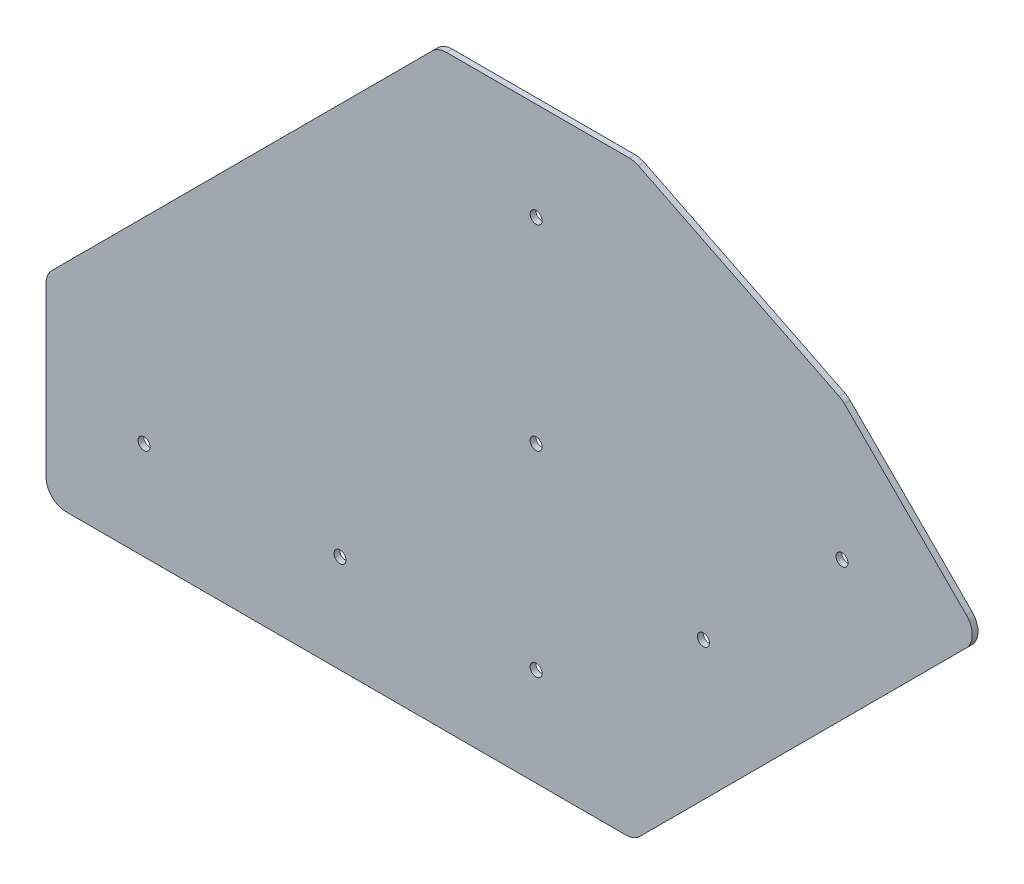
ISO-10303-21;
HEADER;
FILE_DESCRIPTION(('STEP AP214'),'2;1');
FILE_NAME('part.step','',(''),(''),'','','');
FILE_SCHEMA(('AUTOMOTIVE_DESIGN { 1 0 10303 214 1 1 1 1 }'));
ENDSEC;
DATA;
#1=APPLICATION_CONTEXT('core data for automotive mechanical design processes');
#2=APPLICATION_PROTOCOL_DEFINITION('international standard','automotive_design',2000,#1);
#3=PRODUCT_CONTEXT('',#1,'mechanical');
#4=PRODUCT('Part','Part','',(#3));
#5=PRODUCT_RELATED_PRODUCT_CATEGORY('part','',(#4));
#6=PRODUCT_DEFINITION_FORMATION('','',#4);
#7=PRODUCT_DEFINITION_CONTEXT('part definition',#1,'design');
#8=PRODUCT_DEFINITION('design','',#6,#7);
#9=PRODUCT_DEFINITION_SHAPE('','',#8);
#10=(LENGTH_UNIT() NAMED_UNIT(*) SI_UNIT(.MILLI.,.METRE.));
#11=(NAMED_UNIT(*) PLANE_ANGLE_UNIT() SI_UNIT($,.RADIAN.));
#12=(NAMED_UNIT(*) SI_UNIT($,.STERADIAN.) SOLID_ANGLE_UNIT());
#13=UNCERTAINTY_MEASURE_WITH_UNIT(LENGTH_MEASURE(1.E-05),#10,'distance_accuracy_value','');
#14=(GEOMETRIC_REPRESENTATION_CONTEXT(3) GLOBAL_UNCERTAINTY_ASSIGNED_CONTEXT((#13)) GLOBAL_UNIT_ASSIGNED_CONTEXT((#10,
#11,#12)) REPRESENTATION_CONTEXT('',''));
#15=CARTESIAN_POINT('',(0.,0.,0.));
#16=DIRECTION('',(0.,0.,1.));
#17=DIRECTION('',(1.,0.,0.));
#18=AXIS2_PLACEMENT_3D('',#15,#16,#17);
#19=CARTESIAN_POINT('',(5.55625,0.,0.));
#20=DIRECTION('',(0.,1.,0.));
#21=DIRECTION('',(0.,0.,1.));
#22=AXIS2_PLACEMENT_3D('',#19,#20,#21);
#23=PLANE('',#22);
#24=DIRECTION('',(0.,0.,-1.));
#25=VECTOR('',#24,1.);
#26=CARTESIAN_POINT('',(159.623525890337,0.,0.79375));
#27=LINE('',#26,#25);
#28=CARTESIAN_POINT('',(159.623525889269,0.,0.));
#29=VERTEX_POINT('',#28);
#30=CARTESIAN_POINT('',(159.623525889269,0.,1.5875));
#31=VERTEX_POINT('',#30);
#32=EDGE_CURVE('E177',#29,#31,#27,.F.);
#33=ORIENTED_EDGE('',*,*,#32,.T.);
#34=DIRECTION('',(1.,0.,0.));
#35=VECTOR('',#34,1.);
#36=CARTESIAN_POINT('',(128.2844898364,0.,1.5875));
#37=LINE('',#36,#35);
#38=CARTESIAN_POINT('',(5.55625000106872,0.,1.5875));
#39=VERTEX_POINT('',#38);
#40=EDGE_CURVE('E222',#39,#31,#37,.T.);
#41=ORIENTED_EDGE('',*,*,#40,.F.);
#42=DIRECTION('',(0.,0.,1.));
#43=VECTOR('',#42,1.);
#44=CARTESIAN_POINT('',(5.55625000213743,0.,0.79375));
#45=LINE('',#44,#43);
#46=CARTESIAN_POINT('',(5.55625000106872,0.,0.));
#47=VERTEX_POINT('',#46);
#48=EDGE_CURVE('E141',#39,#47,#45,.F.);
#49=ORIENTED_EDGE('',*,*,#48,.T.);
#50=DIRECTION('',(1.,0.,0.));
#51=VECTOR('',#50,1.);
#52=CARTESIAN_POINT('',(128.2844898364,0.,0.));
#53=LINE('',#52,#51);
#54=EDGE_CURVE('E246',#47,#29,#53,.T.);
#55=ORIENTED_EDGE('',*,*,#54,.T.);
#56=EDGE_LOOP('',(#33,#41,#49,#55));
#57=FACE_BOUND('',#56,.T.);
#58=ADVANCED_FACE('F15',(#57),#23,.F.);
#59=CARTESIAN_POINT('',(159.6235258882,5.55625,1.5875));
#60=DIRECTION('',(0.,0.,-1.));
#61=DIRECTION('',(0.,1.,0.));
#62=AXIS2_PLACEMENT_3D('',#59,#60,#61);
#63=CYLINDRICAL_SURFACE('',#62,5.55624999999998);
#64=ORIENTED_EDGE('',*,*,#32,.F.);
#65=CARTESIAN_POINT('',(159.6235258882,5.55625,0.));
#66=DIRECTION('',(0.,0.,-1.));
#67=DIRECTION('',(0.,1.,0.));
#68=AXIS2_PLACEMENT_3D('',#65,#66,#67);
#69=CIRCLE('',#68,5.55624999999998);
#70=CARTESIAN_POINT('',(163.55238795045,1.62738795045,0.));
#71=VERTEX_POINT('',#70);
#72=EDGE_CURVE('E243',#29,#71,#69,.F.);
#73=ORIENTED_EDGE('',*,*,#72,.T.);
#74=DIRECTION('',(0.,0.,1.));
#75=VECTOR('',#74,1.);
#76=CARTESIAN_POINT('',(163.5523879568,1.6273879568,0.79375));
#77=LINE('',#76,#75);
#78=CARTESIAN_POINT('',(163.552387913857,1.62738798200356,1.5875));
#79=VERTEX_POINT('',#78);
#80=EDGE_CURVE('E174',#71,#79,#77,.T.);
#81=ORIENTED_EDGE('',*,*,#80,.T.);
#82=CARTESIAN_POINT('',(159.6235258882,5.55625,1.5875));
#83=DIRECTION('',(0.,0.,-1.));
#84=DIRECTION('',(0.,1.,0.));
#85=AXIS2_PLACEMENT_3D('',#82,#83,#84);
#86=CIRCLE('',#85,5.55624999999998);
#87=EDGE_CURVE('E220',#31,#79,#86,.F.);
#88=ORIENTED_EDGE('',*,*,#87,.F.);
#89=EDGE_LOOP('',(#64,#73,#81,#88));
#90=FACE_BOUND('',#89,.T.);
#91=ADVANCED_FACE('F277',(#90),#63,.T.);
#92=CARTESIAN_POINT('',(253.4113592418,91.4863592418,0.));
#93=DIRECTION('',(-0.707106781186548,0.707106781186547,0.));
#94=DIRECTION('',(-0.707106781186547,-0.707106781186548,0.));
#95=AXIS2_PLACEMENT_3D('',#92,#93,#94);
#96=PLANE('',#95);
#97=ORIENTED_EDGE('',*,*,#80,.F.);
#98=DIRECTION('',(-0.707106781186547,-0.707106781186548,0.));
#99=VECTOR('',#98,1.);
#100=CARTESIAN_POINT('',(253.4113592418,91.4863592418,0.));
#101=LINE('',#100,#99);
#102=CARTESIAN_POINT('',(253.411359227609,91.486359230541,0.));
#103=VERTEX_POINT('',#102);
#104=EDGE_CURVE('E241',#71,#103,#101,.F.);
#105=ORIENTED_EDGE('',*,*,#104,.T.);
#106=DIRECTION('',(0.,0.,-1.));
#107=VECTOR('',#106,1.);
#108=CARTESIAN_POINT('',(253.411359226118,91.4863592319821,0.79375));
#109=LINE('',#108,#107);
#110=CARTESIAN_POINT('',(253.411359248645,91.4863592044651,1.5875));
#111=VERTEX_POINT('',#110);
#112=EDGE_CURVE('E115',#103,#111,#109,.F.);
#113=ORIENTED_EDGE('',*,*,#112,.T.);
#114=DIRECTION('',(0.707106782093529,0.707106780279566,0.));
#115=VECTOR('',#114,1.);
#116=CARTESIAN_POINT('',(163.552387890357,1.62738802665,1.5875));
#117=LINE('',#116,#115);
#118=EDGE_CURVE('E218',#79,#111,#117,.T.);
#119=ORIENTED_EDGE('',*,*,#118,.F.);
#120=EDGE_LOOP('',(#97,#105,#113,#119));
#121=FACE_BOUND('',#120,.T.);
#122=ADVANCED_FACE('F273',(#121),#96,.F.);
#123=CARTESIAN_POINT('',(249.4824971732,95.415221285,1.5875));
#124=DIRECTION('',(0.,0.,-1.));
#125=DIRECTION('',(0.,1.,0.));
#126=AXIS2_PLACEMENT_3D('',#123,#124,#125);
#127=CYLINDRICAL_SURFACE('',#126,5.55625000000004);
#128=ORIENTED_EDGE('',*,*,#112,.F.);
#129=CARTESIAN_POINT('',(249.4824971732,95.415221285,0.));
#130=DIRECTION('',(0.,0.,-1.));
#131=DIRECTION('',(0.,1.,0.));
#132=AXIS2_PLACEMENT_3D('',#129,#130,#131);
#133=CIRCLE('',#132,5.55625000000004);
#134=CARTESIAN_POINT('',(253.41135923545,99.34408333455,0.));
#135=VERTEX_POINT('',#134);
#136=EDGE_CURVE('E19',#103,#135,#133,.F.);
#137=ORIENTED_EDGE('',*,*,#136,.T.);
#138=DIRECTION('',(0.,0.,1.));
#139=VECTOR('',#138,1.);
#140=CARTESIAN_POINT('',(253.4113592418,99.3440833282,0.79375));
#141=LINE('',#140,#139);
#142=CARTESIAN_POINT('',(253.411359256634,99.344083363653,1.5875));
#143=VERTEX_POINT('',#142);
#144=EDGE_CURVE('E122',#135,#143,#141,.T.);
#145=ORIENTED_EDGE('',*,*,#144,.T.);
#146=CARTESIAN_POINT('',(249.4824971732,95.415221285,1.5875));
#147=DIRECTION('',(0.,0.,-1.));
#148=DIRECTION('',(0.,1.,0.));
#149=AXIS2_PLACEMENT_3D('',#146,#147,#148);
#150=CIRCLE('',#149,5.55625000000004);
#151=EDGE_CURVE('E216',#111,#143,#150,.F.);
#152=ORIENTED_EDGE('',*,*,#151,.F.);
#153=EDGE_LOOP('',(#128,#137,#145,#152));
#154=FACE_BOUND('',#153,.T.);
#155=ADVANCED_FACE('F139',(#154),#127,.T.);
#156=CARTESIAN_POINT('',(219.8196307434,132.9358118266,0.));
#157=DIRECTION('',(-0.707106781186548,-0.707106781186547,0.));
#158=DIRECTION('',(0.707106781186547,-0.707106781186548,0.));
#159=AXIS2_PLACEMENT_3D('',#156,#157,#158);
#160=PLANE('',#159);
#161=ORIENTED_EDGE('',*,*,#144,.F.);
#162=DIRECTION('',(0.707106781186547,-0.707106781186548,0.));
#163=VECTOR('',#162,1.);
#164=CARTESIAN_POINT('',(219.8196307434,132.9358118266,0.));
#165=LINE('',#164,#163);
#166=CARTESIAN_POINT('',(219.819630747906,132.935811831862,0.));
#167=VERTEX_POINT('',#166);
#168=EDGE_CURVE('E126',#135,#167,#165,.F.);
#169=ORIENTED_EDGE('',*,*,#168,.T.);
#170=DIRECTION('',(0.,0.,-1.));
#171=VECTOR('',#170,1.);
#172=CARTESIAN_POINT('',(219.819630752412,132.935811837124,0.79375));
#173=LINE('',#172,#171);
#174=CARTESIAN_POINT('',(219.819630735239,132.935811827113,1.5875));
#175=VERTEX_POINT('',#174);
#176=EDGE_CURVE('E128',#167,#175,#173,.F.);
#177=ORIENTED_EDGE('',*,*,#176,.T.);
#178=DIRECTION('',(-0.707106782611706,0.707106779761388,0.));
#179=VECTOR('',#178,1.);
#180=CARTESIAN_POINT('',(253.4113593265,99.344083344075,1.5875));
#181=LINE('',#180,#179);
#182=EDGE_CURVE('E127',#143,#175,#181,.T.);
#183=ORIENTED_EDGE('',*,*,#182,.F.);
#184=EDGE_LOOP('',(#161,#169,#177,#183));
#185=FACE_BOUND('',#184,.T.);
#186=ADVANCED_FACE('F124',(#185),#160,.F.);
#187=CARTESIAN_POINT('',(215.8907687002,129.0069497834,1.5875));
#188=DIRECTION('',(0.,0.,-1.));
#189=DIRECTION('',(0.,1.,0.));
#190=AXIS2_PLACEMENT_3D('',#187,#188,#189);
#191=CYLINDRICAL_SURFACE('',#190,5.55625000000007);
#192=ORIENTED_EDGE('',*,*,#176,.F.);
#193=CARTESIAN_POINT('',(215.8907687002,129.0069497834,0.));
#194=DIRECTION('',(0.,0.,-1.));
#195=DIRECTION('',(0.,1.,0.));
#196=AXIS2_PLACEMENT_3D('',#193,#194,#195);
#197=CIRCLE('',#196,5.55625000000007);
#198=CARTESIAN_POINT('',(218.356036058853,133.986344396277,0.));
#199=VERTEX_POINT('',#198);
#200=EDGE_CURVE('E138',#167,#199,#197,.F.);
#201=ORIENTED_EDGE('',*,*,#200,.T.);
#202=DIRECTION('',(0.,0.,1.));
#203=VECTOR('',#202,1.);
#204=CARTESIAN_POINT('',(218.3560360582,133.9863443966,0.79375));
#205=LINE('',#204,#203);
#206=CARTESIAN_POINT('',(218.356036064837,133.986344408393,1.5875));
#207=VERTEX_POINT('',#206);
#208=EDGE_CURVE('E169',#199,#207,#205,.T.);
#209=ORIENTED_EDGE('',*,*,#208,.T.);
#210=CARTESIAN_POINT('',(215.8907687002,129.0069497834,1.5875));
#211=DIRECTION('',(0.,0.,-1.));
#212=DIRECTION('',(0.,1.,0.));
#213=AXIS2_PLACEMENT_3D('',#210,#211,#212);
#214=CIRCLE('',#213,5.55625000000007);
#215=EDGE_CURVE('E213',#175,#207,#214,.F.);
#216=ORIENTED_EDGE('',*,*,#215,.F.);
#217=EDGE_LOOP('',(#192,#201,#209,#216));
#218=FACE_BOUND('',#217,.T.);
#219=ADVANCED_FACE('F267',(#218),#191,.T.);
#220=CARTESIAN_POINT('',(163.0901436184,161.3481446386,0.));
#221=DIRECTION('',(-0.443692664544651,-0.896179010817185,0.));
#222=DIRECTION('',(0.896179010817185,-0.443692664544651,0.));
#223=AXIS2_PLACEMENT_3D('',#220,#221,#222);
#224=PLANE('',#223);
#225=ORIENTED_EDGE('',*,*,#208,.F.);
#226=DIRECTION('',(0.896179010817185,-0.443692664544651,0.));
#227=VECTOR('',#226,1.);
#228=CARTESIAN_POINT('',(163.0901436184,161.3481446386,0.));
#229=LINE('',#228,#227);
#230=CARTESIAN_POINT('',(163.090143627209,161.348144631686,0.));
#231=VERTEX_POINT('',#230);
#232=EDGE_CURVE('E263',#199,#231,#229,.F.);
#233=ORIENTED_EDGE('',*,*,#232,.T.);
#234=DIRECTION('',(0.,0.,-1.));
#235=VECTOR('',#234,1.);
#236=CARTESIAN_POINT('',(163.090143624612,161.34814463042,0.79375));
#237=LINE('',#236,#235);
#238=CARTESIAN_POINT('',(163.090143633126,161.348144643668,1.5875));
#239=VERTEX_POINT('',#238);
#240=EDGE_CURVE('E166',#231,#239,#237,.F.);
#241=ORIENTED_EDGE('',*,*,#240,.T.);
#242=DIRECTION('',(-0.896179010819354,0.44369266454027,0.));
#243=VECTOR('',#242,1.);
#244=CARTESIAN_POINT('',(218.356036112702,133.986344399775,1.5875));
#245=LINE('',#244,#243);
#246=EDGE_CURVE('E211',#207,#239,#245,.T.);
#247=ORIENTED_EDGE('',*,*,#246,.F.);
#248=EDGE_LOOP('',(#225,#233,#241,#247));
#249=FACE_BOUND('',#248,.T.);
#250=ADVANCED_FACE('F308',(#249),#224,.F.);
#251=CARTESIAN_POINT('',(160.6248762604,156.36875,1.5875));
#252=DIRECTION('',(0.,0.,-1.));
#253=DIRECTION('',(0.,1.,0.));
#254=AXIS2_PLACEMENT_3D('',#251,#252,#253);
#255=CYLINDRICAL_SURFACE('',#254,5.55624999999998);
#256=ORIENTED_EDGE('',*,*,#240,.F.);
#257=CARTESIAN_POINT('',(160.6248762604,156.36875,0.));
#258=DIRECTION('',(0.,0.,-1.));
#259=DIRECTION('',(0.,1.,0.));
#260=AXIS2_PLACEMENT_3D('',#257,#258,#259);
#261=CIRCLE('',#260,5.55624999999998);
#262=CARTESIAN_POINT('',(160.6248762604,161.925,0.));
#263=VERTEX_POINT('',#262);
#264=EDGE_CURVE('E260',#231,#263,#261,.F.);
#265=ORIENTED_EDGE('',*,*,#264,.T.);
#266=DIRECTION('',(0.,0.,1.));
#267=VECTOR('',#266,1.);
#268=CARTESIAN_POINT('',(160.6248762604,161.925,0.79375));
#269=LINE('',#268,#267);
#270=CARTESIAN_POINT('',(160.6248762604,161.925,1.5875));
#271=VERTEX_POINT('',#270);
#272=EDGE_CURVE('E163',#263,#271,#269,.T.);
#273=ORIENTED_EDGE('',*,*,#272,.T.);
#274=CARTESIAN_POINT('',(160.6248762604,156.36875,1.5875));
#275=DIRECTION('',(0.,0.,-1.));
#276=DIRECTION('',(0.,1.,0.));
#277=AXIS2_PLACEMENT_3D('',#274,#275,#276);
#278=CIRCLE('',#277,5.55624999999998);
#279=EDGE_CURVE('E209',#239,#271,#278,.F.);
#280=ORIENTED_EDGE('',*,*,#279,.F.);
#281=EDGE_LOOP('',(#256,#265,#273,#280));
#282=FACE_BOUND('',#281,.T.);
#283=ADVANCED_FACE('F305',(#282),#255,.T.);
#284=CARTESIAN_POINT('',(110.2514741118,161.925,1.5875));
#285=DIRECTION('',(0.,-1.,0.));
#286=DIRECTION('',(0.,0.,-1.));
#287=AXIS2_PLACEMENT_3D('',#284,#285,#286);
#288=PLANE('',#287);
#289=ORIENTED_EDGE('',*,*,#272,.F.);
#290=DIRECTION('',(-1.,0.,0.));
#291=VECTOR('',#290,1.);
#292=CARTESIAN_POINT('',(128.2844898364,161.925,0.));
#293=LINE('',#292,#291);
#294=CARTESIAN_POINT('',(110.25147411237,161.925,0.));
#295=VERTEX_POINT('',#294);
#296=EDGE_CURVE('E149',#263,#295,#293,.T.);
#297=ORIENTED_EDGE('',*,*,#296,.T.);
#298=DIRECTION('',(0.,0.,-1.));
#299=VECTOR('',#298,1.);
#300=CARTESIAN_POINT('',(110.25147411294,161.925,0.79375));
#301=LINE('',#300,#299);
#302=CARTESIAN_POINT('',(110.25147411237,161.925,1.5875));
#303=VERTEX_POINT('',#302);
#304=EDGE_CURVE('E160',#295,#303,#301,.F.);
#305=ORIENTED_EDGE('',*,*,#304,.T.);
#306=DIRECTION('',(-1.,0.,0.));
#307=VECTOR('',#306,1.);
#308=CARTESIAN_POINT('',(128.2844898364,161.925,1.5875));
#309=LINE('',#308,#307);
#310=EDGE_CURVE('E208',#271,#303,#309,.T.);
#311=ORIENTED_EDGE('',*,*,#310,.F.);
#312=EDGE_LOOP('',(#289,#297,#305,#311));
#313=FACE_BOUND('',#312,.T.);
#314=ADVANCED_FACE('F302',(#313),#288,.F.);
#315=CARTESIAN_POINT('',(110.2514741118,156.36875,1.5875));
#316=DIRECTION('',(0.,0.,-1.));
#317=DIRECTION('',(0.,1.,0.));
#318=AXIS2_PLACEMENT_3D('',#315,#316,#317);
#319=CYLINDRICAL_SURFACE('',#318,5.55625000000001);
#320=ORIENTED_EDGE('',*,*,#304,.F.);
#321=CARTESIAN_POINT('',(110.2514741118,156.36875,0.));
#322=DIRECTION('',(0.,0.,-1.));
#323=DIRECTION('',(0.,1.,0.));
#324=AXIS2_PLACEMENT_3D('',#321,#322,#323);
#325=CIRCLE('',#324,5.55625000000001);
#326=CARTESIAN_POINT('',(106.32261204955,160.29761204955,0.));
#327=VERTEX_POINT('',#326);
#328=EDGE_CURVE('E257',#295,#327,#325,.F.);
#329=ORIENTED_EDGE('',*,*,#328,.T.);
#330=DIRECTION('',(0.,0.,1.));
#331=VECTOR('',#330,1.);
#332=CARTESIAN_POINT('',(106.3226120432,160.2976120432,0.79375));
#333=LINE('',#332,#331);
#334=CARTESIAN_POINT('',(106.32261208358,160.29761201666,1.5875));
#335=VERTEX_POINT('',#334);
#336=EDGE_CURVE('E157',#327,#335,#333,.T.);
#337=ORIENTED_EDGE('',*,*,#336,.T.);
#338=CARTESIAN_POINT('',(110.2514741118,156.36875,1.5875));
#339=DIRECTION('',(0.,0.,-1.));
#340=DIRECTION('',(0.,1.,0.));
#341=AXIS2_PLACEMENT_3D('',#338,#339,#340);
#342=CIRCLE('',#341,5.55625000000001);
#343=EDGE_CURVE('E206',#303,#335,#342,.F.);
#344=ORIENTED_EDGE('',*,*,#343,.F.);
#345=EDGE_LOOP('',(#320,#329,#337,#344));
#346=FACE_BOUND('',#345,.T.);
#347=ADVANCED_FACE('F298',(#346),#319,.T.);
#348=CARTESIAN_POINT('',(1.6273879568,55.6023879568,0.));
#349=DIRECTION('',(0.707106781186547,-0.707106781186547,0.));
#350=DIRECTION('',(0.707106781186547,0.707106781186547,0.));
#351=AXIS2_PLACEMENT_3D('',#348,#349,#350);
#352=PLANE('',#351);
#353=ORIENTED_EDGE('',*,*,#336,.F.);
#354=DIRECTION('',(0.707106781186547,0.707106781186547,0.));
#355=VECTOR('',#354,1.);
#356=CARTESIAN_POINT('',(1.6273879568,55.6023879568,0.));
#357=LINE('',#356,#355);
#358=CARTESIAN_POINT('',(1.62738794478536,55.6023879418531,0.));
#359=VERTEX_POINT('',#358);
#360=EDGE_CURVE('E254',#327,#359,#357,.F.);
#361=ORIENTED_EDGE('',*,*,#360,.T.);
#362=DIRECTION('',(0.,0.,-1.));
#363=VECTOR('',#362,1.);
#364=CARTESIAN_POINT('',(1.62738794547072,55.6023879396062,0.79375));
#365=LINE('',#364,#363);
#366=CARTESIAN_POINT('',(1.62738796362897,55.6023879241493,1.5875));
#367=VERTEX_POINT('',#366);
#368=EDGE_CURVE('E154',#359,#367,#365,.F.);
#369=ORIENTED_EDGE('',*,*,#368,.T.);
#370=DIRECTION('',(-0.707106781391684,-0.707106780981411,0.));
#371=VECTOR('',#370,1.);
#372=CARTESIAN_POINT('',(106.322612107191,160.29761197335,1.5875));
#373=LINE('',#372,#371);
#374=EDGE_CURVE('E204',#335,#367,#373,.T.);
#375=ORIENTED_EDGE('',*,*,#374,.F.);
#376=EDGE_LOOP('',(#353,#361,#369,#375));
#377=FACE_BOUND('',#376,.T.);
#378=ADVANCED_FACE('F293',(#377),#352,.F.);
#379=CARTESIAN_POINT('',(5.55625,51.6735258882,1.5875));
#380=DIRECTION('',(0.,0.,-1.));
#381=DIRECTION('',(0.,1.,0.));
#382=AXIS2_PLACEMENT_3D('',#379,#380,#381);
#383=CYLINDRICAL_SURFACE('',#382,5.55625);
#384=ORIENTED_EDGE('',*,*,#368,.F.);
#385=CARTESIAN_POINT('',(5.55625,51.6735258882,0.));
#386=DIRECTION('',(0.,0.,-1.));
#387=DIRECTION('',(0.,1.,0.));
#388=AXIS2_PLACEMENT_3D('',#385,#386,#387);
#389=CIRCLE('',#388,5.55625);
#390=CARTESIAN_POINT('',(0.,51.6735258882,0.));
#391=VERTEX_POINT('',#390);
#392=EDGE_CURVE('E251',#359,#391,#389,.F.);
#393=ORIENTED_EDGE('',*,*,#392,.T.);
#394=DIRECTION('',(0.,0.,1.));
#395=VECTOR('',#394,1.);
#396=CARTESIAN_POINT('',(0.,51.6735258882,0.79375));
#397=LINE('',#396,#395);
#398=CARTESIAN_POINT('',(0.,51.6735258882,1.5875));
#399=VERTEX_POINT('',#398);
#400=EDGE_CURVE('E146',#391,#399,#397,.T.);
#401=ORIENTED_EDGE('',*,*,#400,.T.);
#402=CARTESIAN_POINT('',(5.55625,51.6735258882,1.5875));
#403=DIRECTION('',(0.,0.,-1.));
#404=DIRECTION('',(0.,1.,0.));
#405=AXIS2_PLACEMENT_3D('',#402,#403,#404);
#406=CIRCLE('',#405,5.55625);
#407=EDGE_CURVE('E202',#367,#399,#406,.F.);
#408=ORIENTED_EDGE('',*,*,#407,.F.);
#409=EDGE_LOOP('',(#384,#393,#401,#408));
#410=FACE_BOUND('',#409,.T.);
#411=ADVANCED_FACE('F289',(#410),#383,.T.);
#412=CARTESIAN_POINT('',(0.,5.55625,0.));
#413=DIRECTION('',(1.,0.,0.));
#414=DIRECTION('',(0.,1.,0.));
#415=AXIS2_PLACEMENT_3D('',#412,#413,#414);
#416=PLANE('',#415);
#417=DIRECTION('',(0.,0.,-1.));
#418=VECTOR('',#417,1.);
#419=CARTESIAN_POINT('',(0.,5.55624999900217,0.79375));
#420=LINE('',#419,#418);
#421=CARTESIAN_POINT('',(0.,5.55624999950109,0.));
#422=VERTEX_POINT('',#421);
#423=CARTESIAN_POINT('',(0.,5.55624999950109,1.5875));
#424=VERTEX_POINT('',#423);
#425=EDGE_CURVE('E140',#422,#424,#420,.F.);
#426=ORIENTED_EDGE('',*,*,#425,.T.);
#427=DIRECTION('',(0.,-1.,0.));
#428=VECTOR('',#427,1.);
#429=CARTESIAN_POINT('',(0.,80.9625,1.5875));
#430=LINE('',#429,#428);
#431=EDGE_CURVE('E34',#399,#424,#430,.T.);
#432=ORIENTED_EDGE('',*,*,#431,.F.);
#433=ORIENTED_EDGE('',*,*,#400,.F.);
#434=DIRECTION('',(0.,-1.,0.));
#435=VECTOR('',#434,1.);
#436=CARTESIAN_POINT('',(0.,80.9625,0.));
#437=LINE('',#436,#435);
#438=EDGE_CURVE('E250',#391,#422,#437,.T.);
#439=ORIENTED_EDGE('',*,*,#438,.T.);
#440=EDGE_LOOP('',(#426,#432,#433,#439));
#441=FACE_BOUND('',#440,.T.);
#442=ADVANCED_FACE('F285',(#441),#416,.F.);
#443=CARTESIAN_POINT('',(5.55625,5.55625,1.5875));
#444=DIRECTION('',(0.,0.,-1.));
#445=DIRECTION('',(0.,1.,0.));
#446=AXIS2_PLACEMENT_3D('',#443,#444,#445);
#447=CYLINDRICAL_SURFACE('',#446,5.55625);
#448=ORIENTED_EDGE('',*,*,#425,.F.);
#449=CARTESIAN_POINT('',(5.55625,5.55625,0.));
#450=DIRECTION('',(0.,0.,-1.));
#451=DIRECTION('',(0.,1.,0.));
#452=AXIS2_PLACEMENT_3D('',#449,#450,#451);
#453=CIRCLE('',#452,5.55625);
#454=EDGE_CURVE('E247',#422,#47,#453,.F.);
#455=ORIENTED_EDGE('',*,*,#454,.T.);
#456=ORIENTED_EDGE('',*,*,#48,.F.);
#457=CARTESIAN_POINT('',(5.55625,5.55625,1.5875));
#458=DIRECTION('',(0.,0.,-1.));
#459=DIRECTION('',(0.,1.,0.));
#460=AXIS2_PLACEMENT_3D('',#457,#458,#459);
#461=CIRCLE('',#460,5.55625);
#462=EDGE_CURVE('E200',#424,#39,#461,.F.);
#463=ORIENTED_EDGE('',*,*,#462,.F.);
#464=EDGE_LOOP('',(#448,#455,#456,#463));
#465=FACE_BOUND('',#464,.T.);
#466=ADVANCED_FACE('F353',(#465),#447,.T.);
#467=CARTESIAN_POINT('',(134.9375,80.9625,0.));
#468=DIRECTION('',(0.,0.,1.));
#469=DIRECTION('',(1.,0.,0.));
#470=AXIS2_PLACEMENT_3D('',#467,#468,#469);
#471=CYLINDRICAL_SURFACE('',#470,1.65100000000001);
#472=CARTESIAN_POINT('',(134.9375,80.9625,1.5875));
#473=DIRECTION('',(0.,0.,1.));
#474=DIRECTION('',(1.,0.,0.));
#475=AXIS2_PLACEMENT_3D('',#472,#473,#474);
#476=CIRCLE('',#475,1.65100000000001);
#477=CARTESIAN_POINT('',(136.5885,80.9625,1.5875));
#478=VERTEX_POINT('',#477);
#479=EDGE_CURVE('E197',#478,#478,#476,.F.);
#480=ORIENTED_EDGE('',*,*,#479,.F.);
#481=EDGE_LOOP('',(#480));
#482=FACE_BOUND('',#481,.T.);
#483=CARTESIAN_POINT('',(134.9375,80.9625,0.));
#484=DIRECTION('',(0.,0.,1.));
#485=DIRECTION('',(1.,0.,0.));
#486=AXIS2_PLACEMENT_3D('',#483,#484,#485);
#487=CIRCLE('',#486,1.65100000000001);
#488=CARTESIAN_POINT('',(136.5885,80.9625,0.));
#489=VERTEX_POINT('',#488);
#490=EDGE_CURVE('E238',#489,#489,#487,.F.);
#491=ORIENTED_EDGE('',*,*,#490,.T.);
#492=EDGE_LOOP('',(#491));
#493=FACE_BOUND('',#492,.T.);
#494=ADVANCED_FACE('F349',(#482,#493),#471,.F.);
#495=CARTESIAN_POINT('',(26.9875,26.9875,0.));
#496=DIRECTION('',(0.,0.,1.));
#497=DIRECTION('',(1.,0.,0.));
#498=AXIS2_PLACEMENT_3D('',#495,#496,#497);
#499=CYLINDRICAL_SURFACE('',#498,1.651);
#500=CARTESIAN_POINT('',(26.9875,26.9875,1.5875));
#501=DIRECTION('',(0.,0.,1.));
#502=DIRECTION('',(1.,0.,0.));
#503=AXIS2_PLACEMENT_3D('',#500,#501,#502);
#504=CIRCLE('',#503,1.651);
#505=CARTESIAN_POINT('',(28.6385,26.9875,1.5875));
#506=VERTEX_POINT('',#505);
#507=EDGE_CURVE('E194',#506,#506,#504,.F.);
#508=ORIENTED_EDGE('',*,*,#507,.F.);
#509=EDGE_LOOP('',(#508));
#510=FACE_BOUND('',#509,.T.);
#511=CARTESIAN_POINT('',(26.9875,26.9875,0.));
#512=DIRECTION('',(0.,0.,1.));
#513=DIRECTION('',(1.,0.,0.));
#514=AXIS2_PLACEMENT_3D('',#511,#512,#513);
#515=CIRCLE('',#514,1.651);
#516=CARTESIAN_POINT('',(28.6385,26.9875,0.));
#517=VERTEX_POINT('',#516);
#518=EDGE_CURVE('E235',#517,#517,#515,.F.);
#519=ORIENTED_EDGE('',*,*,#518,.T.);
#520=EDGE_LOOP('',(#519));
#521=FACE_BOUND('',#520,.T.);
#522=ADVANCED_FACE('F345',(#510,#521),#499,.F.);
#523=CARTESIAN_POINT('',(80.9625,26.9875,0.));
#524=DIRECTION('',(0.,0.,1.));
#525=DIRECTION('',(1.,0.,0.));
#526=AXIS2_PLACEMENT_3D('',#523,#524,#525);
#527=CYLINDRICAL_SURFACE('',#526,1.65099999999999);
#528=CARTESIAN_POINT('',(80.9625,26.9875,1.5875));
#529=DIRECTION('',(0.,0.,1.));
#530=DIRECTION('',(1.,0.,0.));
#531=AXIS2_PLACEMENT_3D('',#528,#529,#530);
#532=CIRCLE('',#531,1.65099999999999);
#533=CARTESIAN_POINT('',(82.6135,26.9875,1.5875));
#534=VERTEX_POINT('',#533);
#535=EDGE_CURVE('E191',#534,#534,#532,.F.);
#536=ORIENTED_EDGE('',*,*,#535,.F.);
#537=EDGE_LOOP('',(#536));
#538=FACE_BOUND('',#537,.T.);
#539=CARTESIAN_POINT('',(80.9625,26.9875,0.));
#540=DIRECTION('',(0.,0.,1.));
#541=DIRECTION('',(1.,0.,0.));
#542=AXIS2_PLACEMENT_3D('',#539,#540,#541);
#543=CIRCLE('',#542,1.65099999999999);
#544=CARTESIAN_POINT('',(82.6135,26.9875,0.));
#545=VERTEX_POINT('',#544);
#546=EDGE_CURVE('E232',#545,#545,#543,.F.);
#547=ORIENTED_EDGE('',*,*,#546,.T.);
#548=EDGE_LOOP('',(#547));
#549=FACE_BOUND('',#548,.T.);
#550=ADVANCED_FACE('F341',(#538,#549),#527,.F.);
#551=CARTESIAN_POINT('',(181.008044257,57.249132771,0.));
#552=DIRECTION('',(0.,0.,1.));
#553=DIRECTION('',(1.,0.,0.));
#554=AXIS2_PLACEMENT_3D('',#551,#552,#553);
#555=CYLINDRICAL_SURFACE('',#554,1.65100000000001);
#556=CARTESIAN_POINT('',(181.008044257,57.249132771,1.5875));
#557=DIRECTION('',(0.,0.,1.));
#558=DIRECTION('',(1.,0.,0.));
#559=AXIS2_PLACEMENT_3D('',#556,#557,#558);
#560=CIRCLE('',#559,1.65100000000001);
#561=CARTESIAN_POINT('',(182.659044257,57.249132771,1.5875));
#562=VERTEX_POINT('',#561);
#563=EDGE_CURVE('E188',#562,#562,#560,.F.);
#564=ORIENTED_EDGE('',*,*,#563,.F.);
#565=EDGE_LOOP('',(#564));
#566=FACE_BOUND('',#565,.T.);
#567=CARTESIAN_POINT('',(181.008044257,57.249132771,0.));
#568=DIRECTION('',(0.,0.,1.));
#569=DIRECTION('',(1.,0.,0.));
#570=AXIS2_PLACEMENT_3D('',#567,#568,#569);
#571=CIRCLE('',#570,1.65100000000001);
#572=CARTESIAN_POINT('',(182.659044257,57.249132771,0.));
#573=VERTEX_POINT('',#572);
#574=EDGE_CURVE('E229',#573,#573,#571,.F.);
#575=ORIENTED_EDGE('',*,*,#574,.T.);
#576=EDGE_LOOP('',(#575));
#577=FACE_BOUND('',#576,.T.);
#578=ADVANCED_FACE('F337',(#566,#577),#555,.F.);
#579=CARTESIAN_POINT('',(219.174132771,95.415221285,0.));
#580=DIRECTION('',(0.,0.,1.));
#581=DIRECTION('',(1.,0.,0.));
#582=AXIS2_PLACEMENT_3D('',#579,#580,#581);
#583=CYLINDRICAL_SURFACE('',#582,1.65100000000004);
#584=CARTESIAN_POINT('',(219.174132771,95.415221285,1.5875));
#585=DIRECTION('',(0.,0.,1.));
#586=DIRECTION('',(1.,0.,0.));
#587=AXIS2_PLACEMENT_3D('',#584,#585,#586);
#588=CIRCLE('',#587,1.65100000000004);
#589=CARTESIAN_POINT('',(220.825132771,95.415221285,1.5875));
#590=VERTEX_POINT('',#589);
#591=EDGE_CURVE('E185',#590,#590,#588,.F.);
#592=ORIENTED_EDGE('',*,*,#591,.F.);
#593=EDGE_LOOP('',(#592));
#594=FACE_BOUND('',#593,.T.);
#595=CARTESIAN_POINT('',(219.174132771,95.415221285,0.));
#596=DIRECTION('',(0.,0.,1.));
#597=DIRECTION('',(1.,0.,0.));
#598=AXIS2_PLACEMENT_3D('',#595,#596,#597);
#599=CIRCLE('',#598,1.65100000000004);
#600=CARTESIAN_POINT('',(220.825132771,95.415221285,0.));
#601=VERTEX_POINT('',#600);
#602=EDGE_CURVE('E226',#601,#601,#599,.F.);
#603=ORIENTED_EDGE('',*,*,#602,.T.);
#604=EDGE_LOOP('',(#603));
#605=FACE_BOUND('',#604,.T.);
#606=ADVANCED_FACE('F333',(#594,#605),#583,.F.);
#607=CARTESIAN_POINT('',(134.9375,26.9875,0.));
#608=DIRECTION('',(0.,0.,1.));
#609=DIRECTION('',(1.,0.,0.));
#610=AXIS2_PLACEMENT_3D('',#607,#608,#609);
#611=CYLINDRICAL_SURFACE('',#610,1.65100000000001);
#612=CARTESIAN_POINT('',(134.9375,26.9875,1.5875));
#613=DIRECTION('',(0.,0.,1.));
#614=DIRECTION('',(1.,0.,0.));
#615=AXIS2_PLACEMENT_3D('',#612,#613,#614);
#616=CIRCLE('',#615,1.65100000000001);
#617=CARTESIAN_POINT('',(136.5885,26.9875,1.5875));
#618=VERTEX_POINT('',#617);
#619=EDGE_CURVE('E182',#618,#618,#616,.F.);
#620=ORIENTED_EDGE('',*,*,#619,.F.);
#621=EDGE_LOOP('',(#620));
#622=FACE_BOUND('',#621,.T.);
#623=CARTESIAN_POINT('',(134.9375,26.9875,0.));
#624=DIRECTION('',(0.,0.,1.));
#625=DIRECTION('',(1.,0.,0.));
#626=AXIS2_PLACEMENT_3D('',#623,#624,#625);
#627=CIRCLE('',#626,1.65100000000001);
#628=CARTESIAN_POINT('',(136.5885,26.9875,0.));
#629=VERTEX_POINT('',#628);
#630=EDGE_CURVE('E223',#629,#629,#627,.F.);
#631=ORIENTED_EDGE('',*,*,#630,.T.);
#632=EDGE_LOOP('',(#631));
#633=FACE_BOUND('',#632,.T.);
#634=ADVANCED_FACE('F330',(#622,#633),#611,.F.);
#635=CARTESIAN_POINT('',(0.,0.,0.));
#636=DIRECTION('',(0.,0.,1.));
#637=DIRECTION('',(1.,0.,0.));
#638=AXIS2_PLACEMENT_3D('',#635,#636,#637);
#639=PLANE('',#638);
#640=ORIENTED_EDGE('',*,*,#630,.F.);
#641=EDGE_LOOP('',(#640));
#642=FACE_BOUND('',#641,.T.);
#643=ORIENTED_EDGE('',*,*,#602,.F.);
#644=EDGE_LOOP('',(#643));
#645=FACE_BOUND('',#644,.T.);
#646=ORIENTED_EDGE('',*,*,#574,.F.);
#647=EDGE_LOOP('',(#646));
#648=FACE_BOUND('',#647,.T.);
#649=ORIENTED_EDGE('',*,*,#546,.F.);
#650=EDGE_LOOP('',(#649));
#651=FACE_BOUND('',#650,.T.);
#652=ORIENTED_EDGE('',*,*,#518,.F.);
#653=EDGE_LOOP('',(#652));
#654=FACE_BOUND('',#653,.T.);
#655=ORIENTED_EDGE('',*,*,#490,.F.);
#656=EDGE_LOOP('',(#655));
#657=FACE_BOUND('',#656,.T.);
#658=CARTESIAN_POINT('',(134.9375,134.9375,0.));
#659=DIRECTION('',(0.,0.,1.));
#660=DIRECTION('',(1.,0.,0.));
#661=AXIS2_PLACEMENT_3D('',#658,#659,#660);
#662=CIRCLE('',#661,1.65100000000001);
#663=CARTESIAN_POINT('',(136.5885,134.9375,0.));
#664=VERTEX_POINT('',#663);
#665=EDGE_CURVE('E25',#664,#664,#662,.F.);
#666=ORIENTED_EDGE('',*,*,#665,.F.);
#667=EDGE_LOOP('',(#666));
#668=FACE_BOUND('',#667,.T.);
#669=ORIENTED_EDGE('',*,*,#72,.F.);
#670=ORIENTED_EDGE('',*,*,#54,.F.);
#671=ORIENTED_EDGE('',*,*,#454,.F.);
#672=ORIENTED_EDGE('',*,*,#438,.F.);
#673=ORIENTED_EDGE('',*,*,#392,.F.);
#674=ORIENTED_EDGE('',*,*,#360,.F.);
#675=ORIENTED_EDGE('',*,*,#328,.F.);
#676=ORIENTED_EDGE('',*,*,#296,.F.);
#677=ORIENTED_EDGE('',*,*,#264,.F.);
#678=ORIENTED_EDGE('',*,*,#232,.F.);
#679=ORIENTED_EDGE('',*,*,#200,.F.);
#680=ORIENTED_EDGE('',*,*,#168,.F.);
#681=ORIENTED_EDGE('',*,*,#136,.F.);
#682=ORIENTED_EDGE('',*,*,#104,.F.);
#683=EDGE_LOOP('',(#669,#670,#671,#672,#673,#674,#675,#676,#677,#678,#679,#680,#681,#682));
#684=FACE_BOUND('',#683,.T.);
#685=ADVANCED_FACE('F133',(#642,#645,#648,#651,#654,#657,#668,#684),#639,.F.);
#686=CARTESIAN_POINT('',(0.,0.,1.5875));
#687=DIRECTION('',(0.,0.,1.));
#688=DIRECTION('',(1.,0.,0.));
#689=AXIS2_PLACEMENT_3D('',#686,#687,#688);
#690=PLANE('',#689);
#691=ORIENTED_EDGE('',*,*,#619,.T.);
#692=EDGE_LOOP('',(#691));
#693=FACE_BOUND('',#692,.T.);
#694=ORIENTED_EDGE('',*,*,#591,.T.);
#695=EDGE_LOOP('',(#694));
#696=FACE_BOUND('',#695,.T.);
#697=ORIENTED_EDGE('',*,*,#563,.T.);
#698=EDGE_LOOP('',(#697));
#699=FACE_BOUND('',#698,.T.);
#700=ORIENTED_EDGE('',*,*,#535,.T.);
#701=EDGE_LOOP('',(#700));
#702=FACE_BOUND('',#701,.T.);
#703=ORIENTED_EDGE('',*,*,#507,.T.);
#704=EDGE_LOOP('',(#703));
#705=FACE_BOUND('',#704,.T.);
#706=ORIENTED_EDGE('',*,*,#479,.T.);
#707=EDGE_LOOP('',(#706));
#708=FACE_BOUND('',#707,.T.);
#709=CARTESIAN_POINT('',(134.9375,134.9375,1.5875));
#710=DIRECTION('',(0.,0.,1.));
#711=DIRECTION('',(1.,0.,0.));
#712=AXIS2_PLACEMENT_3D('',#709,#710,#711);
#713=CIRCLE('',#712,1.65100000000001);
#714=CARTESIAN_POINT('',(136.5885,134.9375,1.5875));
#715=VERTEX_POINT('',#714);
#716=EDGE_CURVE('E9',#715,#715,#713,.T.);
#717=ORIENTED_EDGE('',*,*,#716,.F.);
#718=EDGE_LOOP('',(#717));
#719=FACE_BOUND('',#718,.T.);
#720=ORIENTED_EDGE('',*,*,#431,.T.);
#721=ORIENTED_EDGE('',*,*,#462,.T.);
#722=ORIENTED_EDGE('',*,*,#40,.T.);
#723=ORIENTED_EDGE('',*,*,#87,.T.);
#724=ORIENTED_EDGE('',*,*,#118,.T.);
#725=ORIENTED_EDGE('',*,*,#151,.T.);
#726=ORIENTED_EDGE('',*,*,#182,.T.);
#727=ORIENTED_EDGE('',*,*,#215,.T.);
#728=ORIENTED_EDGE('',*,*,#246,.T.);
#729=ORIENTED_EDGE('',*,*,#279,.T.);
#730=ORIENTED_EDGE('',*,*,#310,.T.);
#731=ORIENTED_EDGE('',*,*,#343,.T.);
#732=ORIENTED_EDGE('',*,*,#374,.T.);
#733=ORIENTED_EDGE('',*,*,#407,.T.);
#734=EDGE_LOOP('',(#720,#721,#722,#723,#724,#725,#726,#727,#728,#729,#730,#731,#732,#733));
#735=FACE_BOUND('',#734,.T.);
#736=ADVANCED_FACE('F17',(#693,#696,#699,#702,#705,#708,#719,#735),#690,.T.);
#737=CARTESIAN_POINT('',(134.9375,134.9375,0.));
#738=DIRECTION('',(0.,0.,1.));
#739=DIRECTION('',(1.,0.,0.));
#740=AXIS2_PLACEMENT_3D('',#737,#738,#739);
#741=CYLINDRICAL_SURFACE('',#740,1.65100000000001);
#742=ORIENTED_EDGE('',*,*,#665,.T.);
#743=EDGE_LOOP('',(#742));
#744=FACE_BOUND('',#743,.T.);
#745=ORIENTED_EDGE('',*,*,#716,.T.);
#746=EDGE_LOOP('',(#745));
#747=FACE_BOUND('',#746,.T.);
#748=ADVANCED_FACE('F320',(#744,#747),#741,.F.);
#749=CLOSED_SHELL('',(#58,#91,#122,#155,#186,#219,#250,#283,#314,#347,#378,#411,#442,#466,#494,
#522,#550,#578,#606,#634,#685,#736,#748));
#750=MANIFOLD_SOLID_BREP('B1',#749);
#751=ADVANCED_BREP_SHAPE_REPRESENTATION('',(#18,#750),#14);
#752=SHAPE_DEFINITION_REPRESENTATION(#9,#751);
ENDSEC;
END-ISO-10303-21;
